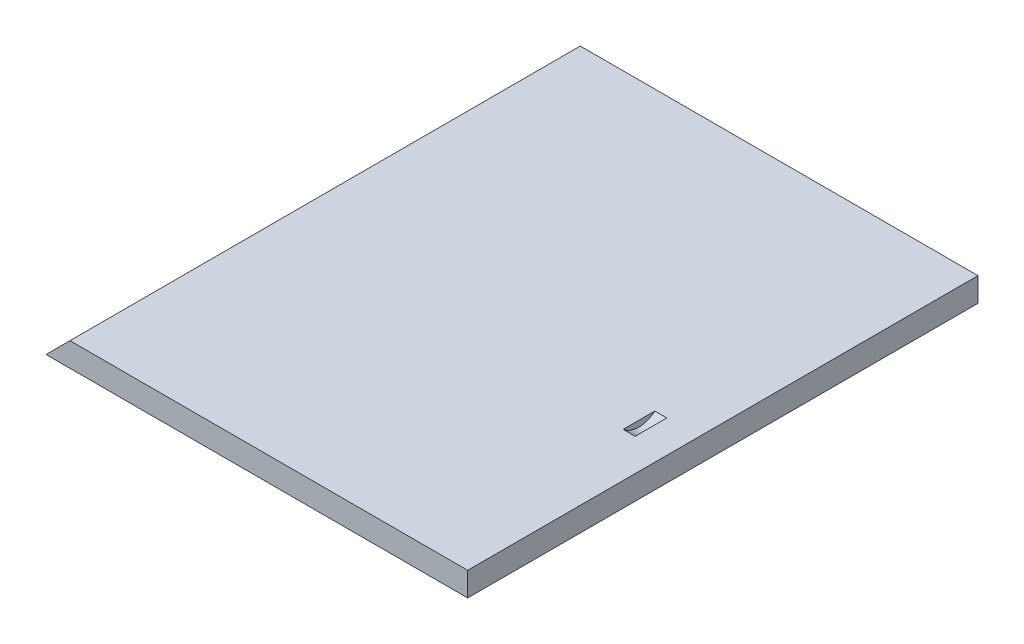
ISO-10303-21;
HEADER;
FILE_DESCRIPTION(('STEP AP214'),'2;1');
FILE_NAME('part.step','',(''),(''),'','','');
FILE_SCHEMA(('AUTOMOTIVE_DESIGN { 1 0 10303 214 1 1 1 1 }'));
ENDSEC;
DATA;
#1=APPLICATION_CONTEXT('core data for automotive mechanical design processes');
#2=APPLICATION_PROTOCOL_DEFINITION('international standard','automotive_design',2000,#1);
#3=PRODUCT_CONTEXT('',#1,'mechanical');
#4=PRODUCT('Part','Part','',(#3));
#5=PRODUCT_RELATED_PRODUCT_CATEGORY('part','',(#4));
#6=PRODUCT_DEFINITION_FORMATION('','',#4);
#7=PRODUCT_DEFINITION_CONTEXT('part definition',#1,'design');
#8=PRODUCT_DEFINITION('design','',#6,#7);
#9=PRODUCT_DEFINITION_SHAPE('','',#8);
#10=(LENGTH_UNIT() NAMED_UNIT(*) SI_UNIT(.MILLI.,.METRE.));
#11=(NAMED_UNIT(*) PLANE_ANGLE_UNIT() SI_UNIT($,.RADIAN.));
#12=(NAMED_UNIT(*) SI_UNIT($,.STERADIAN.) SOLID_ANGLE_UNIT());
#13=UNCERTAINTY_MEASURE_WITH_UNIT(LENGTH_MEASURE(1.E-05),#10,'distance_accuracy_value','');
#14=(GEOMETRIC_REPRESENTATION_CONTEXT(3) GLOBAL_UNCERTAINTY_ASSIGNED_CONTEXT((#13)) GLOBAL_UNIT_ASSIGNED_CONTEXT((#10,
#11,#12)) REPRESENTATION_CONTEXT('',''));
#15=CARTESIAN_POINT('',(0.,0.,0.));
#16=DIRECTION('',(0.,0.,1.));
#17=DIRECTION('',(1.,0.,0.));
#18=AXIS2_PLACEMENT_3D('',#15,#16,#17);
#19=CARTESIAN_POINT('',(0.,0.,0.));
#20=DIRECTION('',(0.,0.,1.));
#21=DIRECTION('',(1.,0.,0.));
#22=AXIS2_PLACEMENT_3D('',#19,#20,#21);
#23=PLANE('',#22);
#24=DIRECTION('',(1.,0.,0.));
#25=VECTOR('',#24,1.);
#26=CARTESIAN_POINT('',(-180.,-10.,0.));
#27=LINE('',#26,#25);
#28=CARTESIAN_POINT('',(-180.,-10.,0.));
#29=VERTEX_POINT('',#28);
#30=CARTESIAN_POINT('',(172.,-10.,0.));
#31=VERTEX_POINT('',#30);
#32=EDGE_CURVE('E9',#29,#31,#27,.T.);
#33=ORIENTED_EDGE('',*,*,#32,.T.);
#34=DIRECTION('',(0.,1.,0.));
#35=VECTOR('',#34,1.);
#36=CARTESIAN_POINT('',(172.,-10.,0.));
#37=LINE('',#36,#35);
#38=CARTESIAN_POINT('',(172.,10.,0.));
#39=VERTEX_POINT('',#38);
#40=EDGE_CURVE('E90',#31,#39,#37,.T.);
#41=ORIENTED_EDGE('',*,*,#40,.T.);
#42=DIRECTION('',(-1.,0.,0.));
#43=VECTOR('',#42,1.);
#44=CARTESIAN_POINT('',(172.,10.,0.));
#45=LINE('',#44,#43);
#46=CARTESIAN_POINT('',(-160.,10.,0.));
#47=VERTEX_POINT('',#46);
#48=EDGE_CURVE('E24',#39,#47,#45,.T.);
#49=ORIENTED_EDGE('',*,*,#48,.T.);
#50=DIRECTION('',(-0.707106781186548,-0.707106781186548,0.));
#51=VECTOR('',#50,1.);
#52=CARTESIAN_POINT('',(-160.,10.,0.));
#53=LINE('',#52,#51);
#54=EDGE_CURVE('E132',#47,#29,#53,.T.);
#55=ORIENTED_EDGE('',*,*,#54,.T.);
#56=EDGE_LOOP('',(#33,#41,#49,#55));
#57=FACE_BOUND('',#56,.T.);
#58=ADVANCED_FACE('F15',(#57),#23,.T.);
#59=CARTESIAN_POINT('',(-160.,-10.,0.));
#60=DIRECTION('',(0.,-1.,0.));
#61=DIRECTION('',(0.,0.,-1.));
#62=AXIS2_PLACEMENT_3D('',#59,#60,#61);
#63=PLANE('',#62);
#64=DIRECTION('',(0.,0.,1.));
#65=VECTOR('',#64,1.);
#66=CARTESIAN_POINT('',(172.,-10.,-426.));
#67=LINE('',#66,#65);
#68=CARTESIAN_POINT('',(172.,-10.,-426.));
#69=VERTEX_POINT('',#68);
#70=EDGE_CURVE('E84',#69,#31,#67,.T.);
#71=ORIENTED_EDGE('',*,*,#70,.T.);
#72=ORIENTED_EDGE('',*,*,#32,.F.);
#73=DIRECTION('',(0.,0.,-1.));
#74=VECTOR('',#73,1.);
#75=CARTESIAN_POINT('',(-180.,-10.,0.));
#76=LINE('',#75,#74);
#77=CARTESIAN_POINT('',(-180.,-10.,-426.));
#78=VERTEX_POINT('',#77);
#79=EDGE_CURVE('E98',#29,#78,#76,.T.);
#80=ORIENTED_EDGE('',*,*,#79,.T.);
#81=DIRECTION('',(1.,0.,0.));
#82=VECTOR('',#81,1.);
#83=CARTESIAN_POINT('',(-180.,-10.,-426.));
#84=LINE('',#83,#82);
#85=EDGE_CURVE('E96',#78,#69,#84,.T.);
#86=ORIENTED_EDGE('',*,*,#85,.T.);
#87=EDGE_LOOP('',(#71,#72,#80,#86));
#88=FACE_BOUND('',#87,.T.);
#89=ADVANCED_FACE('F17',(#88),#63,.T.);
#90=CARTESIAN_POINT('',(160.,10.,0.));
#91=DIRECTION('',(0.,1.,0.));
#92=DIRECTION('',(1.,0.,0.));
#93=AXIS2_PLACEMENT_3D('',#90,#91,#92);
#94=PLANE('',#93);
#95=DIRECTION('',(0.,0.,1.));
#96=VECTOR('',#95,1.);
#97=CARTESIAN_POINT('',(145.,10.,-193.228756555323));
#98=LINE('',#97,#96);
#99=CARTESIAN_POINT('',(145.,10.,-193.228756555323));
#100=VERTEX_POINT('',#99);
#101=CARTESIAN_POINT('',(145.,10.,-166.771243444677));
#102=VERTEX_POINT('',#101);
#103=EDGE_CURVE('E115',#100,#102,#98,.T.);
#104=ORIENTED_EDGE('',*,*,#103,.T.);
#105=DIRECTION('',(-1.,0.,0.));
#106=VECTOR('',#105,1.);
#107=CARTESIAN_POINT('',(145.,10.,-166.771243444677));
#108=LINE('',#107,#106);
#109=CARTESIAN_POINT('',(135.,10.,-166.771243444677));
#110=VERTEX_POINT('',#109);
#111=EDGE_CURVE('E123',#102,#110,#108,.T.);
#112=ORIENTED_EDGE('',*,*,#111,.T.);
#113=DIRECTION('',(0.,0.,-1.));
#114=VECTOR('',#113,1.);
#115=CARTESIAN_POINT('',(135.,10.,-166.771243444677));
#116=LINE('',#115,#114);
#117=CARTESIAN_POINT('',(135.,10.,-193.228756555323));
#118=VERTEX_POINT('',#117);
#119=EDGE_CURVE('E129',#110,#118,#116,.T.);
#120=ORIENTED_EDGE('',*,*,#119,.T.);
#121=DIRECTION('',(1.,0.,0.));
#122=VECTOR('',#121,1.);
#123=CARTESIAN_POINT('',(135.,10.,-193.228756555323));
#124=LINE('',#123,#122);
#125=EDGE_CURVE('E126',#118,#100,#124,.T.);
#126=ORIENTED_EDGE('',*,*,#125,.T.);
#127=EDGE_LOOP('',(#104,#112,#120,#126));
#128=FACE_BOUND('',#127,.T.);
#129=DIRECTION('',(0.,0.,-1.));
#130=VECTOR('',#129,1.);
#131=CARTESIAN_POINT('',(-160.,10.,0.));
#132=LINE('',#131,#130);
#133=CARTESIAN_POINT('',(-160.,10.,-426.));
#134=VERTEX_POINT('',#133);
#135=EDGE_CURVE('E135',#47,#134,#132,.T.);
#136=ORIENTED_EDGE('',*,*,#135,.F.);
#137=ORIENTED_EDGE('',*,*,#48,.F.);
#138=DIRECTION('',(0.,0.,-1.));
#139=VECTOR('',#138,1.);
#140=CARTESIAN_POINT('',(172.,10.,0.));
#141=LINE('',#140,#139);
#142=CARTESIAN_POINT('',(172.,10.,-426.));
#143=VERTEX_POINT('',#142);
#144=EDGE_CURVE('E92',#39,#143,#141,.T.);
#145=ORIENTED_EDGE('',*,*,#144,.T.);
#146=DIRECTION('',(-1.,0.,0.));
#147=VECTOR('',#146,1.);
#148=CARTESIAN_POINT('',(172.,10.,-426.));
#149=LINE('',#148,#147);
#150=EDGE_CURVE('E93',#143,#134,#149,.T.);
#151=ORIENTED_EDGE('',*,*,#150,.T.);
#152=EDGE_LOOP('',(#136,#137,#145,#151));
#153=FACE_BOUND('',#152,.T.);
#154=ADVANCED_FACE('F208',(#128,#153),#94,.T.);
#155=CARTESIAN_POINT('',(-160.,10.,0.));
#156=DIRECTION('',(-0.707106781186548,0.707106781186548,0.));
#157=DIRECTION('',(0.,0.,1.));
#158=AXIS2_PLACEMENT_3D('',#155,#156,#157);
#159=PLANE('',#158);
#160=ORIENTED_EDGE('',*,*,#79,.F.);
#161=ORIENTED_EDGE('',*,*,#54,.F.);
#162=ORIENTED_EDGE('',*,*,#135,.T.);
#163=DIRECTION('',(-0.707106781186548,-0.707106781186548,0.));
#164=VECTOR('',#163,1.);
#165=CARTESIAN_POINT('',(-160.,10.,-426.));
#166=LINE('',#165,#164);
#167=EDGE_CURVE('E103',#134,#78,#166,.T.);
#168=ORIENTED_EDGE('',*,*,#167,.T.);
#169=EDGE_LOOP('',(#160,#161,#162,#168));
#170=FACE_BOUND('',#169,.T.);
#171=ADVANCED_FACE('F211',(#170),#159,.T.);
#172=CARTESIAN_POINT('',(140.,25.,-180.));
#173=DIRECTION('',(-1.,0.,0.));
#174=DIRECTION('',(0.,0.,1.));
#175=AXIS2_PLACEMENT_3D('',#172,#173,#174);
#176=CYLINDRICAL_SURFACE('',#175,20.);
#177=ORIENTED_EDGE('',*,*,#111,.F.);
#178=CARTESIAN_POINT('',(145.,25.,-180.));
#179=DIRECTION('',(-1.,0.,0.));
#180=DIRECTION('',(0.,0.,1.));
#181=AXIS2_PLACEMENT_3D('',#178,#179,#180);
#182=CIRCLE('',#181,20.);
#183=EDGE_CURVE('E119',#100,#102,#182,.T.);
#184=ORIENTED_EDGE('',*,*,#183,.F.);
#185=ORIENTED_EDGE('',*,*,#125,.F.);
#186=CARTESIAN_POINT('',(135.,25.,-180.));
#187=DIRECTION('',(1.,0.,0.));
#188=DIRECTION('',(0.,0.,1.));
#189=AXIS2_PLACEMENT_3D('',#186,#187,#188);
#190=CIRCLE('',#189,20.);
#191=EDGE_CURVE('E120',#110,#118,#190,.T.);
#192=ORIENTED_EDGE('',*,*,#191,.F.);
#193=EDGE_LOOP('',(#177,#184,#185,#192));
#194=FACE_BOUND('',#193,.T.);
#195=ADVANCED_FACE('F213',(#194),#176,.F.);
#196=CARTESIAN_POINT('',(145.,25.,-180.));
#197=DIRECTION('',(-1.,0.,0.));
#198=DIRECTION('',(0.,0.,1.));
#199=AXIS2_PLACEMENT_3D('',#196,#197,#198);
#200=PLANE('',#199);
#201=ORIENTED_EDGE('',*,*,#103,.F.);
#202=ORIENTED_EDGE('',*,*,#183,.T.);
#203=EDGE_LOOP('',(#201,#202));
#204=FACE_BOUND('',#203,.T.);
#205=ADVANCED_FACE('F220',(#204),#200,.T.);
#206=CARTESIAN_POINT('',(135.,25.,-180.));
#207=DIRECTION('',(-1.,0.,0.));
#208=DIRECTION('',(0.,0.,1.));
#209=AXIS2_PLACEMENT_3D('',#206,#207,#208);
#210=PLANE('',#209);
#211=ORIENTED_EDGE('',*,*,#119,.F.);
#212=ORIENTED_EDGE('',*,*,#191,.T.);
#213=EDGE_LOOP('',(#211,#212));
#214=FACE_BOUND('',#213,.T.);
#215=ADVANCED_FACE('F232',(#214),#210,.F.);
#216=CARTESIAN_POINT('',(172.,0.,-100.));
#217=DIRECTION('',(1.,0.,0.));
#218=DIRECTION('',(0.,1.,0.));
#219=AXIS2_PLACEMENT_3D('',#216,#217,#218);
#220=PLANE('',#219);
#221=ORIENTED_EDGE('',*,*,#70,.F.);
#222=DIRECTION('',(0.,1.,0.));
#223=VECTOR('',#222,1.);
#224=CARTESIAN_POINT('',(172.,-10.,-426.));
#225=LINE('',#224,#223);
#226=EDGE_CURVE('E89',#69,#143,#225,.T.);
#227=ORIENTED_EDGE('',*,*,#226,.T.);
#228=ORIENTED_EDGE('',*,*,#144,.F.);
#229=ORIENTED_EDGE('',*,*,#40,.F.);
#230=EDGE_LOOP('',(#221,#227,#228,#229));
#231=FACE_BOUND('',#230,.T.);
#232=ADVANCED_FACE('F86',(#231),#220,.T.);
#233=CARTESIAN_POINT('',(-1.07106781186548,-0.273117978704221,-426.));
#234=DIRECTION('',(0.,0.,1.));
#235=DIRECTION('',(1.,0.,0.));
#236=AXIS2_PLACEMENT_3D('',#233,#234,#235);
#237=PLANE('',#236);
#238=ORIENTED_EDGE('',*,*,#226,.F.);
#239=ORIENTED_EDGE('',*,*,#85,.F.);
#240=ORIENTED_EDGE('',*,*,#167,.F.);
#241=ORIENTED_EDGE('',*,*,#150,.F.);
#242=EDGE_LOOP('',(#238,#239,#240,#241));
#243=FACE_BOUND('',#242,.T.);
#244=ADVANCED_FACE('F106',(#243),#237,.F.);
#245=CLOSED_SHELL('',(#58,#89,#154,#171,#195,#205,#215,#232,#244));
#246=MANIFOLD_SOLID_BREP('B1',#245);
#247=ADVANCED_BREP_SHAPE_REPRESENTATION('',(#18,#246),#14);
#248=SHAPE_DEFINITION_REPRESENTATION(#9,#247);
ENDSEC;
END-ISO-10303-21;
